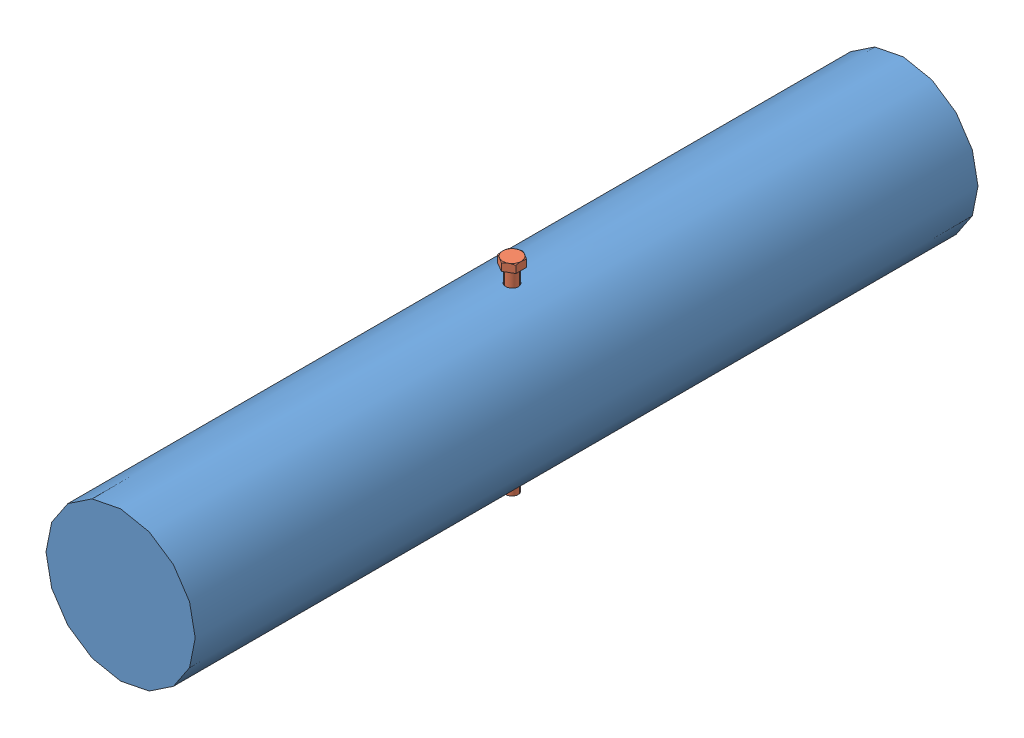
SolidWorks assembly 250 lb Drop Weight.sldasm, configuration Default (file format 7000). Lengths in mm.
Overall size (154.94 211.4 812.8).
5 component instances, 4 part files, 9 mates.
Components (placement in the parent):
- STEEL BAR-1: STEEL BAR.sldprt [Default] at origin size (154.94 154.94 812.8)
- Lift-Eye-18901-1: Lift-Eye-18901.SLDPRT [Default] at (0 77.47 0) x (0 0 1) z (-1 0 0) (suppressed, hidden)
- Hex Head Cap Screws (U.S.)-1: Hex Head Cap Screws (U.S.).SLDPRT [[d96]  ½  -20 UNF x 8] at (0 -109.855 0) x (1 0 0) z (0 1 0) size (19.05 22 211.4)
- Hex Nuts (U.S.)-1: Hex Nuts (U.S.).sldprt [[18]   ½'' -13] at (0 -77.47 0) x (1 0 0) z (0 -1 0) size (19.05 24.19 11.11)
- Hex Nuts (U.S.)-2: Hex Nuts (U.S.).sldprt [[18]   ½'' -13] at (0 -88.5825 0) x (1 0 0) z (0 -1 0) size (19.05 24.19 11.11)
Mates (geometry in assembly coordinates):
- Concentric1: concentric anti-aligned: circle of Lift-Eye-18901-1; cylinder of Hex Head Cap Screws (U.S.)-1 through (0 93.345 0) axis (0 -1 0) radius 6.35
- Coincident1: coincident anti-aligned: plane of Lift-Eye-18901-1 through (0 93.345 0) normal (0 1 0); plane of Hex Head Cap Screws (U.S.)-1 through (-9.525 93.345 -5.4993) normal (0 -1 0)
- Concentric2: concentric anti-aligned: cylinder of STEEL BAR-1 through (0 -77.47 0) axis (0 1 0) radius 6.604; cylinder of Hex Head Cap Screws (U.S.)-1 through (0 93.345 0) axis (0 -1 0) radius 6.35
- Tangent1: tangent anti-aligned: cylinder of STEEL BAR-1 through (0 0 406.4) axis (0 0 -1) radius 77.47; plane of Lift-Eye-18901-1 through (0 77.47 0) normal (0 -1 0)
- Parallel1: parallel anti-aligned: plane of Lift-Eye-18901-1 through (0 77.47 0) normal (-1 0 0); plane of assembly through (0 0 0) normal (1 0 0)
- Concentric3: concentric anti-aligned: cylinder of Hex Head Cap Screws (U.S.)-1 through (0 93.345 0) axis (0 -1 0) radius 6.35; cylinder of Hex Nuts (U.S.)-2 through (0 -99.695 0) axis (0 1 0) radius 6.35
- Concentric4: concentric anti-aligned: cylinder of Hex Head Cap Screws (U.S.)-1 through (0 93.345 0) axis (0 -1 0) radius 6.35; cylinder of Hex Nuts (U.S.)-1 through (0 -88.5825 0) axis (0 1 0) radius 6.35
- Tangent2: tangent anti-aligned: cylinder of STEEL BAR-1 through (0 0 406.4) axis (0 0 -1) radius 77.47; plane of Hex Nuts (U.S.)-1 through (0 -77.47 10.9985) normal (0 1 0)
- Coincident2: coincident anti-aligned: plane of Hex Nuts (U.S.)-1 through (0 -88.5825 10.9985) normal (0 -1 0); plane of Hex Nuts (U.S.)-2 through (0 -88.5825 10.9985) normal (0 1 0)
